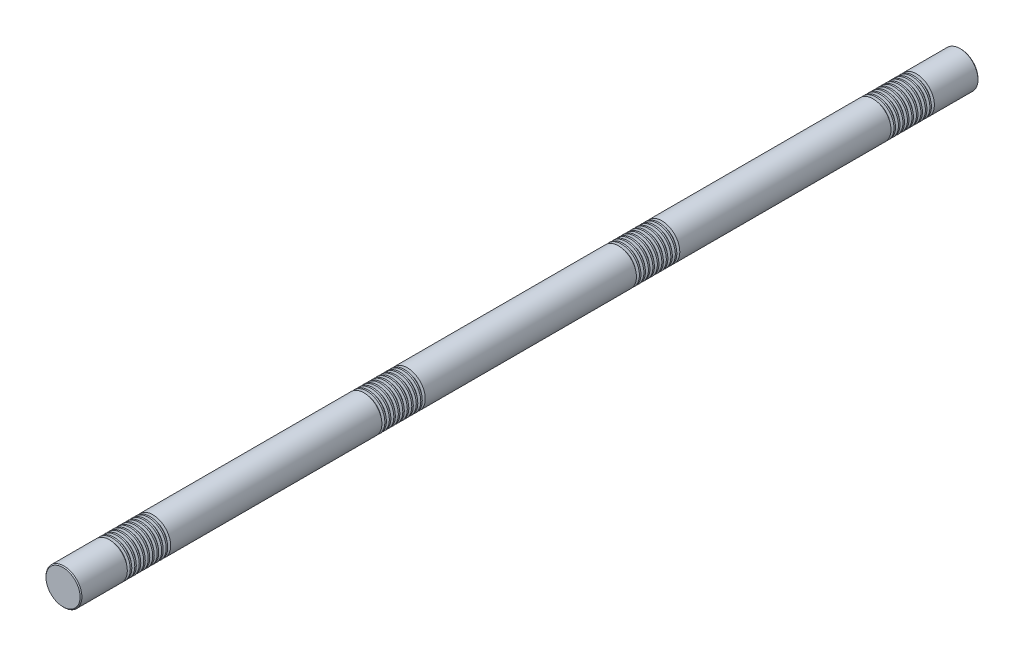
from build123d import *

# Parameters (mm, degrees)
SKETCH1_R           = 40
BOSS_EXTRUDE1_DEPTH = 1000
CHAMFER1_SIZE       = 2
LPATTERN1_COUNT     = 10
LPATTERN1_PITCH     = 10
LPATTERN2_COUNT     = 4
LPATTERN2_PITCH     = 567


with BuildPart() as part:
    # Sketch1 → Boss-Extrude1 (new, symmetric)
    with BuildSketch(Plane.XY):
        Circle(SKETCH1_R)
    extrude(amount=BOSS_EXTRUDE1_DEPTH, both=True)

    # Chamfer1
    chamfer1_edges = [part.edges().sort_by_distance(p)[0] for p in [
        (-40, 0, -1000),
        (-40, 0, 1000),
    ]]
    chamfer(chamfer1_edges, length=CHAMFER1_SIZE)

    # Sketch2 → Cut-Revolve1 (revolve, cut)
    with BuildSketch(Plane(origin=(0, 0, 0), x_dir=(0, 0, -1), z_dir=(1, 0, 0)), mode=Mode.PRIVATE) as cut_revolve1_sk:
        Polygon((900.803847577, 40), (894.196152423, 40), (895.803847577, 34), (899.196152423, 34), align=None)
    cut_revolve1 = revolve(cut_revolve1_sk.sketch.rotate(Axis((0, 0, 1000), (0, 0, -1)), 90), axis=Axis((0, 0, 1000), (0, 0, -1)), mode=Mode.SUBTRACT)

    # LPattern1: Cut-Revolve1 ×10
    with Locations(*[(0, 0, i * LPATTERN1_PITCH) for i in range(1, LPATTERN1_COUNT)]):
        add(cut_revolve1, mode=Mode.SUBTRACT)

    # LPattern2: Cut-Revolve1 ×4
    with Locations(*[(0, 0, i * LPATTERN2_PITCH) for i in range(1, LPATTERN2_COUNT)]):
        add(cut_revolve1, mode=Mode.SUBTRACT)

    # LPattern2 copy 1 sketch → LPattern2 copy 1 (revolve, cut)
    with BuildSketch(Plane(origin=(0, 0, 577), x_dir=(0, 0, -1), z_dir=(1, 0, 0))):
        Polygon((900.803847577, 40), (894.196152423, 40), (895.803847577, 34), (899.196152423, 34), align=None)
    revolve(axis=Axis((0, 0, 1577), (0, 0, -1)), mode=Mode.SUBTRACT)

    # LPattern2 copy 2 sketch → LPattern2 copy 2 (revolve, cut)
    with BuildSketch(Plane(origin=(0, 0, 1144), x_dir=(0, 0, -1), z_dir=(1, 0, 0))):
        Polygon((900.803847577, 40), (894.196152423, 40), (895.803847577, 34), (899.196152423, 34), align=None)
    revolve(axis=Axis((0, 0, 2144), (0, 0, -1)), mode=Mode.SUBTRACT)

    # LPattern2 copy 3 sketch → LPattern2 copy 3 (revolve, cut)
    with BuildSketch(Plane(origin=(0, 0, 1711), x_dir=(0, 0, -1), z_dir=(1, 0, 0))):
        Polygon((900.803847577, 40), (894.196152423, 40), (895.803847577, 34), (899.196152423, 34), align=None)
    revolve(axis=Axis((0, 0, 2711), (0, 0, -1)), mode=Mode.SUBTRACT)

    # LPattern2 copy 4 sketch → LPattern2 copy 4 (revolve, cut)
    with BuildSketch(Plane(origin=(0, 0, 587), x_dir=(0, 0, -1), z_dir=(1, 0, 0))):
        Polygon((900.803847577, 40), (894.196152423, 40), (895.803847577, 34), (899.196152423, 34), align=None)
    revolve(axis=Axis((0, 0, 1587), (0, 0, -1)), mode=Mode.SUBTRACT)

    # LPattern2 copy 5 sketch → LPattern2 copy 5 (revolve, cut)
    with BuildSketch(Plane(origin=(0, 0, 1154), x_dir=(0, 0, -1), z_dir=(1, 0, 0))):
        Polygon((900.803847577, 40), (894.196152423, 40), (895.803847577, 34), (899.196152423, 34), align=None)
    revolve(axis=Axis((0, 0, 2154), (0, 0, -1)), mode=Mode.SUBTRACT)

    # LPattern2 copy 6 sketch → LPattern2 copy 6 (revolve, cut)
    with BuildSketch(Plane(origin=(0, 0, 1721), x_dir=(0, 0, -1), z_dir=(1, 0, 0))):
        Polygon((900.803847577, 40), (894.196152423, 40), (895.803847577, 34), (899.196152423, 34), align=None)
    revolve(axis=Axis((0, 0, 2721), (0, 0, -1)), mode=Mode.SUBTRACT)

    # LPattern2 copy 7 sketch → LPattern2 copy 7 (revolve, cut)
    with BuildSketch(Plane(origin=(0, 0, 597), x_dir=(0, 0, -1), z_dir=(1, 0, 0))):
        Polygon((900.803847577, 40), (894.196152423, 40), (895.803847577, 34), (899.196152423, 34), align=None)
    revolve(axis=Axis((0, 0, 1597), (0, 0, -1)), mode=Mode.SUBTRACT)

    # LPattern2 copy 8 sketch → LPattern2 copy 8 (revolve, cut)
    with BuildSketch(Plane(origin=(0, 0, 1164), x_dir=(0, 0, -1), z_dir=(1, 0, 0))):
        Polygon((900.803847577, 40), (894.196152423, 40), (895.803847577, 34), (899.196152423, 34), align=None)
    revolve(axis=Axis((0, 0, 2164), (0, 0, -1)), mode=Mode.SUBTRACT)

    # LPattern2 copy 9 sketch → LPattern2 copy 9 (revolve, cut)
    with BuildSketch(Plane(origin=(0, 0, 1731), x_dir=(0, 0, -1), z_dir=(1, 0, 0))):
        Polygon((900.803847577, 40), (894.196152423, 40), (895.803847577, 34), (899.196152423, 34), align=None)
    revolve(axis=Axis((0, 0, 2731), (0, 0, -1)), mode=Mode.SUBTRACT)

    # LPattern2 copy 10 sketch → LPattern2 copy 10 (revolve, cut)
    with BuildSketch(Plane(origin=(0, 0, 607), x_dir=(0, 0, -1), z_dir=(1, 0, 0))):
        Polygon((900.803847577, 40), (894.196152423, 40), (895.803847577, 34), (899.196152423, 34), align=None)
    revolve(axis=Axis((0, 0, 1607), (0, 0, -1)), mode=Mode.SUBTRACT)

    # LPattern2 copy 11 sketch → LPattern2 copy 11 (revolve, cut)
    with BuildSketch(Plane(origin=(0, 0, 1174), x_dir=(0, 0, -1), z_dir=(1, 0, 0))):
        Polygon((900.803847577, 40), (894.196152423, 40), (895.803847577, 34), (899.196152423, 34), align=None)
    revolve(axis=Axis((0, 0, 2174), (0, 0, -1)), mode=Mode.SUBTRACT)

    # LPattern2 copy 12 sketch → LPattern2 copy 12 (revolve, cut)
    with BuildSketch(Plane(origin=(0, 0, 1741), x_dir=(0, 0, -1), z_dir=(1, 0, 0))):
        Polygon((900.803847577, 40), (894.196152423, 40), (895.803847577, 34), (899.196152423, 34), align=None)
    revolve(axis=Axis((0, 0, 2741), (0, 0, -1)), mode=Mode.SUBTRACT)

    # LPattern2 copy 13 sketch → LPattern2 copy 13 (revolve, cut)
    with BuildSketch(Plane(origin=(0, 0, 617), x_dir=(0, 0, -1), z_dir=(1, 0, 0))):
        Polygon((900.803847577, 40), (894.196152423, 40), (895.803847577, 34), (899.196152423, 34), align=None)
    revolve(axis=Axis((0, 0, 1617), (0, 0, -1)), mode=Mode.SUBTRACT)

    # LPattern2 copy 14 sketch → LPattern2 copy 14 (revolve, cut)
    with BuildSketch(Plane(origin=(0, 0, 1184), x_dir=(0, 0, -1), z_dir=(1, 0, 0))):
        Polygon((900.803847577, 40), (894.196152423, 40), (895.803847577, 34), (899.196152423, 34), align=None)
    revolve(axis=Axis((0, 0, 2184), (0, 0, -1)), mode=Mode.SUBTRACT)

    # LPattern2 copy 15 sketch → LPattern2 copy 15 (revolve, cut)
    with BuildSketch(Plane(origin=(0, 0, 1751), x_dir=(0, 0, -1), z_dir=(1, 0, 0))):
        Polygon((900.803847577, 40), (894.196152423, 40), (895.803847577, 34), (899.196152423, 34), align=None)
    revolve(axis=Axis((0, 0, 2751), (0, 0, -1)), mode=Mode.SUBTRACT)

    # LPattern2 copy 16 sketch → LPattern2 copy 16 (revolve, cut)
    with BuildSketch(Plane(origin=(0, 0, 627), x_dir=(0, 0, -1), z_dir=(1, 0, 0))):
        Polygon((900.803847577, 40), (894.196152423, 40), (895.803847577, 34), (899.196152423, 34), align=None)
    revolve(axis=Axis((0, 0, 1627), (0, 0, -1)), mode=Mode.SUBTRACT)

    # LPattern2 copy 17 sketch → LPattern2 copy 17 (revolve, cut)
    with BuildSketch(Plane(origin=(0, 0, 1194), x_dir=(0, 0, -1), z_dir=(1, 0, 0))):
        Polygon((900.803847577, 40), (894.196152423, 40), (895.803847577, 34), (899.196152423, 34), align=None)
    revolve(axis=Axis((0, 0, 2194), (0, 0, -1)), mode=Mode.SUBTRACT)

    # LPattern2 copy 18 sketch → LPattern2 copy 18 (revolve, cut)
    with BuildSketch(Plane(origin=(0, 0, 1761), x_dir=(0, 0, -1), z_dir=(1, 0, 0))):
        Polygon((900.803847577, 40), (894.196152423, 40), (895.803847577, 34), (899.196152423, 34), align=None)
    revolve(axis=Axis((0, 0, 2761), (0, 0, -1)), mode=Mode.SUBTRACT)

    # LPattern2 copy 19 sketch → LPattern2 copy 19 (revolve, cut)
    with BuildSketch(Plane(origin=(0, 0, 637), x_dir=(0, 0, -1), z_dir=(1, 0, 0))):
        Polygon((900.803847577, 40), (894.196152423, 40), (895.803847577, 34), (899.196152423, 34), align=None)
    revolve(axis=Axis((0, 0, 1637), (0, 0, -1)), mode=Mode.SUBTRACT)

    # LPattern2 copy 20 sketch → LPattern2 copy 20 (revolve, cut)
    with BuildSketch(Plane(origin=(0, 0, 1204), x_dir=(0, 0, -1), z_dir=(1, 0, 0))):
        Polygon((900.803847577, 40), (894.196152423, 40), (895.803847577, 34), (899.196152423, 34), align=None)
    revolve(axis=Axis((0, 0, 2204), (0, 0, -1)), mode=Mode.SUBTRACT)

    # LPattern2 copy 21 sketch → LPattern2 copy 21 (revolve, cut)
    with BuildSketch(Plane(origin=(0, 0, 1771), x_dir=(0, 0, -1), z_dir=(1, 0, 0))):
        Polygon((900.803847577, 40), (894.196152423, 40), (895.803847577, 34), (899.196152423, 34), align=None)
    revolve(axis=Axis((0, 0, 2771), (0, 0, -1)), mode=Mode.SUBTRACT)

    # LPattern2 copy 22 sketch → LPattern2 copy 22 (revolve, cut)
    with BuildSketch(Plane(origin=(0, 0, 647), x_dir=(0, 0, -1), z_dir=(1, 0, 0))):
        Polygon((900.803847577, 40), (894.196152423, 40), (895.803847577, 34), (899.196152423, 34), align=None)
    revolve(axis=Axis((0, 0, 1647), (0, 0, -1)), mode=Mode.SUBTRACT)

    # LPattern2 copy 23 sketch → LPattern2 copy 23 (revolve, cut)
    with BuildSketch(Plane(origin=(0, 0, 1214), x_dir=(0, 0, -1), z_dir=(1, 0, 0))):
        Polygon((900.803847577, 40), (894.196152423, 40), (895.803847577, 34), (899.196152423, 34), align=None)
    revolve(axis=Axis((0, 0, 2214), (0, 0, -1)), mode=Mode.SUBTRACT)

    # LPattern2 copy 24 sketch → LPattern2 copy 24 (revolve, cut)
    with BuildSketch(Plane(origin=(0, 0, 1781), x_dir=(0, 0, -1), z_dir=(1, 0, 0))):
        Polygon((900.803847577, 40), (894.196152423, 40), (895.803847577, 34), (899.196152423, 34), align=None)
    revolve(axis=Axis((0, 0, 2781), (0, 0, -1)), mode=Mode.SUBTRACT)

    # LPattern2 copy 25 sketch → LPattern2 copy 25 (revolve, cut)
    with BuildSketch(Plane(origin=(0, 0, 657), x_dir=(0, 0, -1), z_dir=(1, 0, 0))):
        Polygon((900.803847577, 40), (894.196152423, 40), (895.803847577, 34), (899.196152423, 34), align=None)
    revolve(axis=Axis((0, 0, 1657), (0, 0, -1)), mode=Mode.SUBTRACT)

    # LPattern2 copy 26 sketch → LPattern2 copy 26 (revolve, cut)
    with BuildSketch(Plane(origin=(0, 0, 1224), x_dir=(0, 0, -1), z_dir=(1, 0, 0))):
        Polygon((900.803847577, 40), (894.196152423, 40), (895.803847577, 34), (899.196152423, 34), align=None)
    revolve(axis=Axis((0, 0, 2224), (0, 0, -1)), mode=Mode.SUBTRACT)

    # LPattern2 copy 27 sketch → LPattern2 copy 27 (revolve, cut)
    with BuildSketch(Plane(origin=(0, 0, 1791), x_dir=(0, 0, -1), z_dir=(1, 0, 0))):
        Polygon((900.803847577, 40), (894.196152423, 40), (895.803847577, 34), (899.196152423, 34), align=None)
    revolve(axis=Axis((0, 0, 2791), (0, 0, -1)), mode=Mode.SUBTRACT)


solid = part.part
